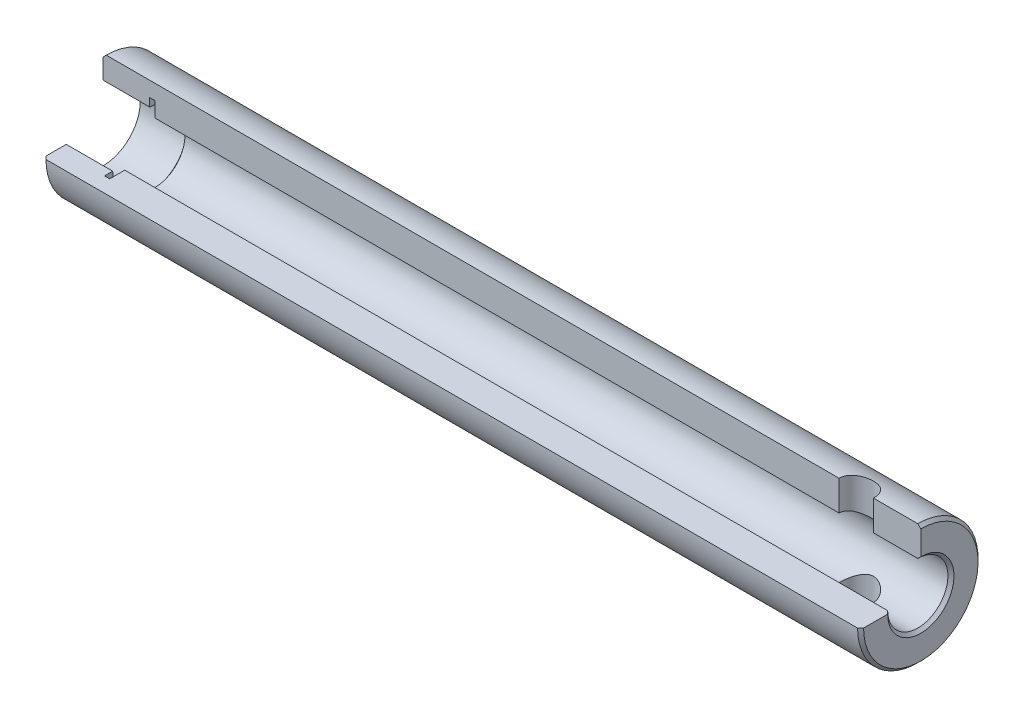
from build123d import *

# Parameters (mm, degrees)
ESQUISSE1_R                         = 7
ESQUISSE1_R_2                       = 3.5
BASE_EXTRUSION_DEPTH                = 95
CHANFREIN1_SIZE                     = 0.35
ENL_V_MAT_EXTRU_2_REACH             = 97.514
ESQUISSE2_R                         = 2
ENL_V_MAT_EXTRU_2_DIRECTION_2_REACH = 97.514
ESQUISSE3_R                         = 4.3
ENL_V_MAT_EXTRU_4_DEPTH             = 6
ENL_V_START                         = 0.6
ESQUISSE6_R                         = 5.25
ESQUISSE6_R_2                       = 3.5
ENL_V_MAT_EXTRU_5_DEPTH             = 0.6
COUPE_REACH                         = 97.514


with BuildPart() as part:
    # Esquisse1 → Base-Extrusion (new body)
    with BuildSketch(Plane(origin=(0, 0, 0), x_dir=(0, 0, -1), z_dir=(1, 0, 0))):
        Circle(ESQUISSE1_R)
        Circle(ESQUISSE1_R_2, mode=Mode.SUBTRACT)
    extrude(amount=BASE_EXTRUSION_DEPTH)

    # Chanfrein1
    chanfrein1_edges = [part.edges().sort_by_distance(p)[0] for p in [
        (0, 0, 7),
        (95, 0, 7),
        (95, 0, 3.5),
    ]]
    chamfer(chanfrein1_edges, length=CHANFREIN1_SIZE)

    # Esquisse2 → Enl_v. mat.-Extru.2 (cut, up to next)
    with BuildSketch(Plane(origin=(0, 0, 0), x_dir=(1, 0, 0), z_dir=(0, 1, 0)), mode=Mode.PRIVATE) as enl_v_mat_extru_2_sk1:
        with Locations(Location((87.5, 0, 0), (0, 0, 90))):
            Circle(ESQUISSE2_R)
    enl_v_mat_extru_2_tool1 = extrude(enl_v_mat_extru_2_sk1.sketch, amount=-ENL_V_MAT_EXTRU_2_REACH, mode=Mode.PRIVATE) & part.part
    add(enl_v_mat_extru_2_tool1.solids().sort_by_distance((87.5, 0, 0))[0], mode=Mode.SUBTRACT)

    # Esquisse2 → Enl_v. mat.-Extru.2 direction 2 (cut, up to next)
    with BuildSketch(Plane(origin=(0, 0, 0), x_dir=(1, 0, 0), z_dir=(0, 1, 0)), mode=Mode.PRIVATE) as enl_v_mat_extru_2_direction_2_sk1:
        with Locations(Location((87.5, 0, 0), (0, 0, 90))):
            Circle(ESQUISSE2_R)
    enl_v_mat_extru_2_direction_2_tool1 = extrude(enl_v_mat_extru_2_direction_2_sk1.sketch, amount=ENL_V_MAT_EXTRU_2_DIRECTION_2_REACH, mode=Mode.PRIVATE) & part.part
    add(enl_v_mat_extru_2_direction_2_tool1.solids().sort_by_distance((87.5, 0, 0))[0], mode=Mode.SUBTRACT)

    # Esquisse3 → Enl_v. mat.-Extru.4 (cut)
    with BuildSketch(Plane.ZY):
        Circle(ESQUISSE3_R)
    extrude(amount=-ENL_V_MAT_EXTRU_4_DEPTH, mode=Mode.SUBTRACT)

    # Esquisse6 → Enl_v. mat.-Extru.5 (cut)
    with BuildSketch(Plane.ZY.offset(-6).offset(ENL_V_START)):
        Circle(ESQUISSE6_R)
        Circle(ESQUISSE6_R_2, mode=Mode.SUBTRACT)
    extrude(amount=-ENL_V_MAT_EXTRU_5_DEPTH, mode=Mode.SUBTRACT)

    # Esquisse5 → COUPE (cut, up to next)
    with BuildSketch(Plane(origin=(0, 0, 0), x_dir=(0, 0, -1), z_dir=(1, 0, 0)), mode=Mode.PRIVATE) as coupe_sk1:
        with BuildLine():
            Line((0, 0), (-7, 0))
            ThreePointArc((-7, 0), (-4.949747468, 4.949747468), (0, 7))
            Line((0, 7), (0, 0))
        make_face()
    coupe_tool1 = extrude(coupe_sk1.sketch, amount=COUPE_REACH, mode=Mode.PRIVATE) & part.part
    add(coupe_tool1.solids().sort_by_distance((0, 2.970892, 2.970892))[0], mode=Mode.SUBTRACT)


solid = part.part
